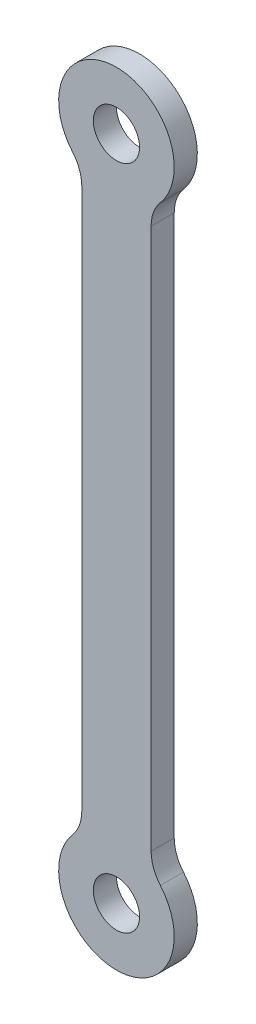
ISO-10303-21;
HEADER;
FILE_DESCRIPTION(('STEP AP214'),'2;1');
FILE_NAME('part.step','',(''),(''),'','','');
FILE_SCHEMA(('AUTOMOTIVE_DESIGN { 1 0 10303 214 1 1 1 1 }'));
ENDSEC;
DATA;
#1=APPLICATION_CONTEXT('core data for automotive mechanical design processes');
#2=APPLICATION_PROTOCOL_DEFINITION('international standard','automotive_design',2000,#1);
#3=PRODUCT_CONTEXT('',#1,'mechanical');
#4=PRODUCT('Part','Part','',(#3));
#5=PRODUCT_RELATED_PRODUCT_CATEGORY('part','',(#4));
#6=PRODUCT_DEFINITION_FORMATION('','',#4);
#7=PRODUCT_DEFINITION_CONTEXT('part definition',#1,'design');
#8=PRODUCT_DEFINITION('design','',#6,#7);
#9=PRODUCT_DEFINITION_SHAPE('','',#8);
#10=(LENGTH_UNIT() NAMED_UNIT(*) SI_UNIT(.MILLI.,.METRE.));
#11=(NAMED_UNIT(*) PLANE_ANGLE_UNIT() SI_UNIT($,.RADIAN.));
#12=(NAMED_UNIT(*) SI_UNIT($,.STERADIAN.) SOLID_ANGLE_UNIT());
#13=UNCERTAINTY_MEASURE_WITH_UNIT(LENGTH_MEASURE(1.E-05),#10,'distance_accuracy_value','');
#14=(GEOMETRIC_REPRESENTATION_CONTEXT(3) GLOBAL_UNCERTAINTY_ASSIGNED_CONTEXT((#13)) GLOBAL_UNIT_ASSIGNED_CONTEXT((#10,
#11,#12)) REPRESENTATION_CONTEXT('',''));
#15=CARTESIAN_POINT('',(0.,0.,0.));
#16=DIRECTION('',(0.,0.,1.));
#17=DIRECTION('',(1.,0.,0.));
#18=AXIS2_PLACEMENT_3D('',#15,#16,#17);
#19=CARTESIAN_POINT('',(0.,0.,6.));
#20=DIRECTION('',(0.,0.,1.));
#21=DIRECTION('',(1.,0.,0.));
#22=AXIS2_PLACEMENT_3D('',#19,#20,#21);
#23=PLANE('',#22);
#24=CARTESIAN_POINT('',(0.,173.,6.));
#25=DIRECTION('',(0.,0.,1.));
#26=DIRECTION('',(1.,0.,0.));
#27=AXIS2_PLACEMENT_3D('',#24,#25,#26);
#28=CIRCLE('',#27,6.);
#29=CARTESIAN_POINT('',(6.,173.,6.));
#30=VERTEX_POINT('',#29);
#31=EDGE_CURVE('E129',#30,#30,#28,.T.);
#32=ORIENTED_EDGE('',*,*,#31,.F.);
#33=EDGE_LOOP('',(#32));
#34=FACE_BOUND('',#33,.T.);
#35=DIRECTION('',(0.,-1.,0.));
#36=VECTOR('',#35,1.);
#37=CARTESIAN_POINT('',(-9.,12.,6.));
#38=LINE('',#37,#36);
#39=CARTESIAN_POINT('',(-9.,156.751923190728,6.));
#40=VERTEX_POINT('',#39);
#41=CARTESIAN_POINT('',(-9.,16.2480768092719,6.));
#42=VERTEX_POINT('',#41);
#43=EDGE_CURVE('E141',#40,#42,#38,.T.);
#44=ORIENTED_EDGE('',*,*,#43,.T.);
#45=CARTESIAN_POINT('',(-19.,16.2480768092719,6.));
#46=DIRECTION('',(0.,0.,1.));
#47=DIRECTION('',(1.,0.,0.));
#48=AXIS2_PLACEMENT_3D('',#45,#46,#47);
#49=CIRCLE('',#48,10.);
#50=CARTESIAN_POINT('',(-11.4,9.74884608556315,6.));
#51=VERTEX_POINT('',#50);
#52=EDGE_CURVE('E160',#42,#51,#49,.F.);
#53=ORIENTED_EDGE('',*,*,#52,.T.);
#54=CARTESIAN_POINT('',(0.,0.,6.));
#55=DIRECTION('',(0.,0.,1.));
#56=DIRECTION('',(1.,0.,0.));
#57=AXIS2_PLACEMENT_3D('',#54,#55,#56);
#58=CIRCLE('',#57,15.);
#59=CARTESIAN_POINT('',(11.4,9.74884608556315,6.));
#60=VERTEX_POINT('',#59);
#61=EDGE_CURVE('E135',#51,#60,#58,.T.);
#62=ORIENTED_EDGE('',*,*,#61,.T.);
#63=CARTESIAN_POINT('',(19.,16.2480768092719,6.));
#64=DIRECTION('',(0.,0.,1.));
#65=DIRECTION('',(1.,0.,0.));
#66=AXIS2_PLACEMENT_3D('',#63,#64,#65);
#67=CIRCLE('',#66,10.);
#68=CARTESIAN_POINT('',(9.,16.2480768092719,6.));
#69=VERTEX_POINT('',#68);
#70=EDGE_CURVE('E109',#60,#69,#67,.F.);
#71=ORIENTED_EDGE('',*,*,#70,.T.);
#72=DIRECTION('',(0.,1.,0.));
#73=VECTOR('',#72,1.);
#74=CARTESIAN_POINT('',(9.,12.,6.));
#75=LINE('',#74,#73);
#76=CARTESIAN_POINT('',(9.,156.751923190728,6.));
#77=VERTEX_POINT('',#76);
#78=EDGE_CURVE('E117',#69,#77,#75,.T.);
#79=ORIENTED_EDGE('',*,*,#78,.T.);
#80=CARTESIAN_POINT('',(19.,156.751923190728,6.));
#81=DIRECTION('',(0.,0.,1.));
#82=DIRECTION('',(1.,0.,0.));
#83=AXIS2_PLACEMENT_3D('',#80,#81,#82);
#84=CIRCLE('',#83,10.);
#85=CARTESIAN_POINT('',(11.4,163.251153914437,6.));
#86=VERTEX_POINT('',#85);
#87=EDGE_CURVE('E11',#77,#86,#84,.F.);
#88=ORIENTED_EDGE('',*,*,#87,.T.);
#89=CARTESIAN_POINT('',(0.,173.,6.));
#90=DIRECTION('',(0.,0.,1.));
#91=DIRECTION('',(1.,0.,0.));
#92=AXIS2_PLACEMENT_3D('',#89,#90,#91);
#93=CIRCLE('',#92,15.);
#94=CARTESIAN_POINT('',(-11.4,163.251153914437,6.));
#95=VERTEX_POINT('',#94);
#96=EDGE_CURVE('E139',#86,#95,#93,.T.);
#97=ORIENTED_EDGE('',*,*,#96,.T.);
#98=CARTESIAN_POINT('',(-19.,156.751923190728,6.));
#99=DIRECTION('',(0.,0.,1.));
#100=DIRECTION('',(1.,0.,0.));
#101=AXIS2_PLACEMENT_3D('',#98,#99,#100);
#102=CIRCLE('',#101,10.);
#103=EDGE_CURVE('E164',#95,#40,#102,.F.);
#104=ORIENTED_EDGE('',*,*,#103,.T.);
#105=EDGE_LOOP('',(#44,#53,#62,#71,#79,#88,#97,#104));
#106=FACE_BOUND('',#105,.T.);
#107=CARTESIAN_POINT('',(0.,0.,6.));
#108=DIRECTION('',(0.,0.,1.));
#109=DIRECTION('',(1.,0.,0.));
#110=AXIS2_PLACEMENT_3D('',#107,#108,#109);
#111=CIRCLE('',#110,6.);
#112=CARTESIAN_POINT('',(6.,0.,6.));
#113=VERTEX_POINT('',#112);
#114=EDGE_CURVE('E303',#113,#113,#111,.T.);
#115=ORIENTED_EDGE('',*,*,#114,.F.);
#116=EDGE_LOOP('',(#115));
#117=FACE_BOUND('',#116,.T.);
#118=ADVANCED_FACE('F34',(#34,#106,#117),#23,.T.);
#119=CARTESIAN_POINT('',(0.,0.,0.));
#120=DIRECTION('',(0.,0.,1.));
#121=DIRECTION('',(1.,0.,0.));
#122=AXIS2_PLACEMENT_3D('',#119,#120,#121);
#123=PLANE('',#122);
#124=CARTESIAN_POINT('',(0.,173.,0.));
#125=DIRECTION('',(0.,0.,1.));
#126=DIRECTION('',(1.,0.,0.));
#127=AXIS2_PLACEMENT_3D('',#124,#125,#126);
#128=CIRCLE('',#127,6.);
#129=CARTESIAN_POINT('',(6.,173.,0.));
#130=VERTEX_POINT('',#129);
#131=EDGE_CURVE('E302',#130,#130,#128,.T.);
#132=ORIENTED_EDGE('',*,*,#131,.T.);
#133=EDGE_LOOP('',(#132));
#134=FACE_BOUND('',#133,.T.);
#135=CARTESIAN_POINT('',(0.,0.,0.));
#136=DIRECTION('',(0.,0.,1.));
#137=DIRECTION('',(1.,0.,0.));
#138=AXIS2_PLACEMENT_3D('',#135,#136,#137);
#139=CIRCLE('',#138,15.);
#140=CARTESIAN_POINT('',(-11.4,9.74884608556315,0.));
#141=VERTEX_POINT('',#140);
#142=CARTESIAN_POINT('',(11.4,9.74884608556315,0.));
#143=VERTEX_POINT('',#142);
#144=EDGE_CURVE('E125',#141,#143,#139,.T.);
#145=ORIENTED_EDGE('',*,*,#144,.F.);
#146=CARTESIAN_POINT('',(-19.,16.2480768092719,0.));
#147=DIRECTION('',(0.,0.,1.));
#148=DIRECTION('',(1.,0.,0.));
#149=AXIS2_PLACEMENT_3D('',#146,#147,#148);
#150=CIRCLE('',#149,10.);
#151=CARTESIAN_POINT('',(-9.,16.2480768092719,0.));
#152=VERTEX_POINT('',#151);
#153=EDGE_CURVE('E158',#141,#152,#150,.T.);
#154=ORIENTED_EDGE('',*,*,#153,.T.);
#155=DIRECTION('',(0.,-1.,0.));
#156=VECTOR('',#155,1.);
#157=CARTESIAN_POINT('',(-9.,12.,0.));
#158=LINE('',#157,#156);
#159=CARTESIAN_POINT('',(-9.,156.751923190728,0.));
#160=VERTEX_POINT('',#159);
#161=EDGE_CURVE('E127',#160,#152,#158,.T.);
#162=ORIENTED_EDGE('',*,*,#161,.F.);
#163=CARTESIAN_POINT('',(-19.,156.751923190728,0.));
#164=DIRECTION('',(0.,0.,1.));
#165=DIRECTION('',(1.,0.,0.));
#166=AXIS2_PLACEMENT_3D('',#163,#164,#165);
#167=CIRCLE('',#166,10.);
#168=CARTESIAN_POINT('',(-11.4,163.251153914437,0.));
#169=VERTEX_POINT('',#168);
#170=EDGE_CURVE('E162',#160,#169,#167,.T.);
#171=ORIENTED_EDGE('',*,*,#170,.T.);
#172=CARTESIAN_POINT('',(0.,173.,0.));
#173=DIRECTION('',(0.,0.,1.));
#174=DIRECTION('',(1.,0.,0.));
#175=AXIS2_PLACEMENT_3D('',#172,#173,#174);
#176=CIRCLE('',#175,15.);
#177=CARTESIAN_POINT('',(11.4,163.251153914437,0.));
#178=VERTEX_POINT('',#177);
#179=EDGE_CURVE('E124',#178,#169,#176,.T.);
#180=ORIENTED_EDGE('',*,*,#179,.F.);
#181=CARTESIAN_POINT('',(19.,156.751923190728,0.));
#182=DIRECTION('',(0.,0.,1.));
#183=DIRECTION('',(1.,0.,0.));
#184=AXIS2_PLACEMENT_3D('',#181,#182,#183);
#185=CIRCLE('',#184,10.);
#186=CARTESIAN_POINT('',(9.,156.751923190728,0.));
#187=VERTEX_POINT('',#186);
#188=EDGE_CURVE('E42',#178,#187,#185,.T.);
#189=ORIENTED_EDGE('',*,*,#188,.T.);
#190=DIRECTION('',(0.,1.,0.));
#191=VECTOR('',#190,1.);
#192=CARTESIAN_POINT('',(9.,12.,0.));
#193=LINE('',#192,#191);
#194=CARTESIAN_POINT('',(9.,16.2480768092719,0.));
#195=VERTEX_POINT('',#194);
#196=EDGE_CURVE('E115',#195,#187,#193,.T.);
#197=ORIENTED_EDGE('',*,*,#196,.F.);
#198=CARTESIAN_POINT('',(19.,16.2480768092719,0.));
#199=DIRECTION('',(0.,0.,1.));
#200=DIRECTION('',(1.,0.,0.));
#201=AXIS2_PLACEMENT_3D('',#198,#199,#200);
#202=CIRCLE('',#201,10.);
#203=EDGE_CURVE('E99',#195,#143,#202,.T.);
#204=ORIENTED_EDGE('',*,*,#203,.T.);
#205=EDGE_LOOP('',(#145,#154,#162,#171,#180,#189,#197,#204));
#206=FACE_BOUND('',#205,.T.);
#207=CARTESIAN_POINT('',(0.,0.,0.));
#208=DIRECTION('',(0.,0.,1.));
#209=DIRECTION('',(1.,0.,0.));
#210=AXIS2_PLACEMENT_3D('',#207,#208,#209);
#211=CIRCLE('',#210,6.);
#212=CARTESIAN_POINT('',(6.,0.,0.));
#213=VERTEX_POINT('',#212);
#214=EDGE_CURVE('E306',#213,#213,#211,.T.);
#215=ORIENTED_EDGE('',*,*,#214,.T.);
#216=EDGE_LOOP('',(#215));
#217=FACE_BOUND('',#216,.T.);
#218=ADVANCED_FACE('F121',(#134,#206,#217),#123,.F.);
#219=CARTESIAN_POINT('',(0.,0.,6.));
#220=DIRECTION('',(0.,0.,-1.));
#221=DIRECTION('',(-1.,0.,0.));
#222=AXIS2_PLACEMENT_3D('',#219,#220,#221);
#223=CYLINDRICAL_SURFACE('',#222,15.);
#224=ORIENTED_EDGE('',*,*,#144,.T.);
#225=DIRECTION('',(0.,0.,-1.));
#226=VECTOR('',#225,1.);
#227=CARTESIAN_POINT('',(11.4,9.74884608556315,6.));
#228=LINE('',#227,#226);
#229=EDGE_CURVE('E104',#143,#60,#228,.F.);
#230=ORIENTED_EDGE('',*,*,#229,.T.);
#231=ORIENTED_EDGE('',*,*,#61,.F.);
#232=DIRECTION('',(0.,0.,-1.));
#233=VECTOR('',#232,1.);
#234=CARTESIAN_POINT('',(-11.4,9.74884608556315,6.));
#235=LINE('',#234,#233);
#236=EDGE_CURVE('E118',#51,#141,#235,.T.);
#237=ORIENTED_EDGE('',*,*,#236,.T.);
#238=EDGE_LOOP('',(#224,#230,#231,#237));
#239=FACE_BOUND('',#238,.T.);
#240=ADVANCED_FACE('F36',(#239),#223,.T.);
#241=CARTESIAN_POINT('',(9.,12.,6.));
#242=DIRECTION('',(-1.,0.,0.));
#243=DIRECTION('',(0.,0.,1.));
#244=AXIS2_PLACEMENT_3D('',#241,#242,#243);
#245=PLANE('',#244);
#246=ORIENTED_EDGE('',*,*,#78,.F.);
#247=DIRECTION('',(0.,0.,1.));
#248=VECTOR('',#247,1.);
#249=CARTESIAN_POINT('',(9.,16.2480768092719,0.));
#250=LINE('',#249,#248);
#251=EDGE_CURVE('E103',#69,#195,#250,.F.);
#252=ORIENTED_EDGE('',*,*,#251,.T.);
#253=ORIENTED_EDGE('',*,*,#196,.T.);
#254=DIRECTION('',(0.,0.,1.));
#255=VECTOR('',#254,1.);
#256=CARTESIAN_POINT('',(9.,156.751923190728,6.));
#257=LINE('',#256,#255);
#258=EDGE_CURVE('E119',#187,#77,#257,.T.);
#259=ORIENTED_EDGE('',*,*,#258,.T.);
#260=EDGE_LOOP('',(#246,#252,#253,#259));
#261=FACE_BOUND('',#260,.T.);
#262=ADVANCED_FACE('F114',(#261),#245,.F.);
#263=CARTESIAN_POINT('',(0.,173.,6.));
#264=DIRECTION('',(0.,0.,-1.));
#265=DIRECTION('',(-1.,0.,0.));
#266=AXIS2_PLACEMENT_3D('',#263,#264,#265);
#267=CYLINDRICAL_SURFACE('',#266,15.);
#268=ORIENTED_EDGE('',*,*,#179,.T.);
#269=DIRECTION('',(0.,0.,-1.));
#270=VECTOR('',#269,1.);
#271=CARTESIAN_POINT('',(-11.4,163.251153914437,6.));
#272=LINE('',#271,#270);
#273=EDGE_CURVE('E49',#169,#95,#272,.F.);
#274=ORIENTED_EDGE('',*,*,#273,.T.);
#275=ORIENTED_EDGE('',*,*,#96,.F.);
#276=DIRECTION('',(0.,0.,-1.));
#277=VECTOR('',#276,1.);
#278=CARTESIAN_POINT('',(11.4,163.251153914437,6.));
#279=LINE('',#278,#277);
#280=EDGE_CURVE('E153',#86,#178,#279,.T.);
#281=ORIENTED_EDGE('',*,*,#280,.T.);
#282=EDGE_LOOP('',(#268,#274,#275,#281));
#283=FACE_BOUND('',#282,.T.);
#284=ADVANCED_FACE('F176',(#283),#267,.T.);
#285=CARTESIAN_POINT('',(-9.,12.,6.));
#286=DIRECTION('',(1.,0.,0.));
#287=DIRECTION('',(0.,0.,-1.));
#288=AXIS2_PLACEMENT_3D('',#285,#286,#287);
#289=PLANE('',#288);
#290=ORIENTED_EDGE('',*,*,#161,.T.);
#291=DIRECTION('',(0.,0.,1.));
#292=VECTOR('',#291,1.);
#293=CARTESIAN_POINT('',(-9.,16.2480768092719,6.));
#294=LINE('',#293,#292);
#295=EDGE_CURVE('E151',#152,#42,#294,.T.);
#296=ORIENTED_EDGE('',*,*,#295,.T.);
#297=ORIENTED_EDGE('',*,*,#43,.F.);
#298=DIRECTION('',(0.,0.,1.));
#299=VECTOR('',#298,1.);
#300=CARTESIAN_POINT('',(-9.,156.751923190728,0.));
#301=LINE('',#300,#299);
#302=EDGE_CURVE('E148',#40,#160,#301,.F.);
#303=ORIENTED_EDGE('',*,*,#302,.T.);
#304=EDGE_LOOP('',(#290,#296,#297,#303));
#305=FACE_BOUND('',#304,.T.);
#306=ADVANCED_FACE('F172',(#305),#289,.F.);
#307=CARTESIAN_POINT('',(0.,173.,6.));
#308=DIRECTION('',(0.,0.,-1.));
#309=DIRECTION('',(-1.,0.,0.));
#310=AXIS2_PLACEMENT_3D('',#307,#308,#309);
#311=CYLINDRICAL_SURFACE('',#310,6.);
#312=ORIENTED_EDGE('',*,*,#31,.T.);
#313=EDGE_LOOP('',(#312));
#314=FACE_BOUND('',#313,.T.);
#315=ORIENTED_EDGE('',*,*,#131,.F.);
#316=EDGE_LOOP('',(#315));
#317=FACE_BOUND('',#316,.T.);
#318=ADVANCED_FACE('F207',(#314,#317),#311,.F.);
#319=CARTESIAN_POINT('',(0.,0.,6.));
#320=DIRECTION('',(0.,0.,-1.));
#321=DIRECTION('',(-1.,0.,0.));
#322=AXIS2_PLACEMENT_3D('',#319,#320,#321);
#323=CYLINDRICAL_SURFACE('',#322,6.);
#324=ORIENTED_EDGE('',*,*,#114,.T.);
#325=EDGE_LOOP('',(#324));
#326=FACE_BOUND('',#325,.T.);
#327=ORIENTED_EDGE('',*,*,#214,.F.);
#328=EDGE_LOOP('',(#327));
#329=FACE_BOUND('',#328,.T.);
#330=ADVANCED_FACE('F192',(#326,#329),#323,.F.);
#331=CARTESIAN_POINT('',(19.,16.2480768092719,6.));
#332=DIRECTION('',(0.,0.,-1.));
#333=DIRECTION('',(-1.,0.,0.));
#334=AXIS2_PLACEMENT_3D('',#331,#332,#333);
#335=CYLINDRICAL_SURFACE('',#334,10.);
#336=ORIENTED_EDGE('',*,*,#70,.F.);
#337=ORIENTED_EDGE('',*,*,#229,.F.);
#338=ORIENTED_EDGE('',*,*,#203,.F.);
#339=ORIENTED_EDGE('',*,*,#251,.F.);
#340=EDGE_LOOP('',(#336,#337,#338,#339));
#341=FACE_BOUND('',#340,.T.);
#342=ADVANCED_FACE('F102',(#341),#335,.F.);
#343=CARTESIAN_POINT('',(-19.,16.2480768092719,6.));
#344=DIRECTION('',(0.,0.,-1.));
#345=DIRECTION('',(-1.,0.,0.));
#346=AXIS2_PLACEMENT_3D('',#343,#344,#345);
#347=CYLINDRICAL_SURFACE('',#346,10.);
#348=ORIENTED_EDGE('',*,*,#52,.F.);
#349=ORIENTED_EDGE('',*,*,#295,.F.);
#350=ORIENTED_EDGE('',*,*,#153,.F.);
#351=ORIENTED_EDGE('',*,*,#236,.F.);
#352=EDGE_LOOP('',(#348,#349,#350,#351));
#353=FACE_BOUND('',#352,.T.);
#354=ADVANCED_FACE('F184',(#353),#347,.F.);
#355=CARTESIAN_POINT('',(-19.,156.751923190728,6.));
#356=DIRECTION('',(0.,0.,-1.));
#357=DIRECTION('',(-1.,0.,0.));
#358=AXIS2_PLACEMENT_3D('',#355,#356,#357);
#359=CYLINDRICAL_SURFACE('',#358,10.);
#360=ORIENTED_EDGE('',*,*,#103,.F.);
#361=ORIENTED_EDGE('',*,*,#273,.F.);
#362=ORIENTED_EDGE('',*,*,#170,.F.);
#363=ORIENTED_EDGE('',*,*,#302,.F.);
#364=EDGE_LOOP('',(#360,#361,#362,#363));
#365=FACE_BOUND('',#364,.T.);
#366=ADVANCED_FACE('F175',(#365),#359,.F.);
#367=CARTESIAN_POINT('',(19.,156.751923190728,6.));
#368=DIRECTION('',(0.,0.,-1.));
#369=DIRECTION('',(-1.,0.,0.));
#370=AXIS2_PLACEMENT_3D('',#367,#368,#369);
#371=CYLINDRICAL_SURFACE('',#370,10.);
#372=ORIENTED_EDGE('',*,*,#87,.F.);
#373=ORIENTED_EDGE('',*,*,#258,.F.);
#374=ORIENTED_EDGE('',*,*,#188,.F.);
#375=ORIENTED_EDGE('',*,*,#280,.F.);
#376=EDGE_LOOP('',(#372,#373,#374,#375));
#377=FACE_BOUND('',#376,.T.);
#378=ADVANCED_FACE('F179',(#377),#371,.F.);
#379=CLOSED_SHELL('',(#118,#218,#240,#262,#284,#306,#318,#330,#342,#354,#366,#378));
#380=MANIFOLD_SOLID_BREP('B2',#379);
#381=ADVANCED_BREP_SHAPE_REPRESENTATION('',(#18,#380),#14);
#382=SHAPE_DEFINITION_REPRESENTATION(#9,#381);
ENDSEC;
END-ISO-10303-21;
